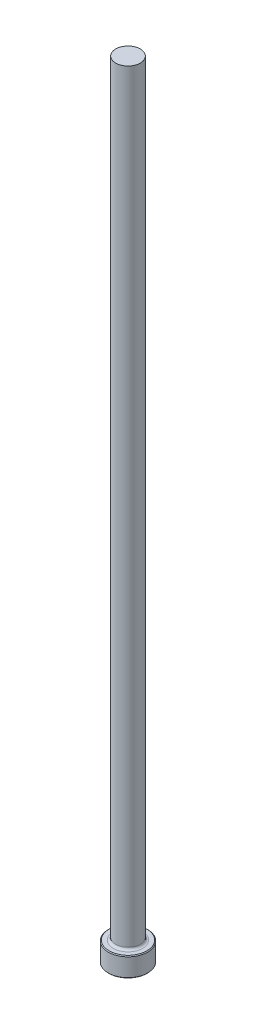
from build123d import *

# Parameters (mm, degrees)
CHAMFER1_SIZE = 0.254
FILLET1_R     = 0.762


with BuildPart() as part:
    # Sketch1 → Revolve1 (revolve)
    with BuildSketch(Plane.XY, mode=Mode.PRIVATE) as revolve1_sk:
        Polygon((0, 0), (-6.35, 0), (-6.35, 6.35), (-3.96875, 6.35), (-3.96875, 254), (0, 254), align=None)
    revolve(revolve1_sk.sketch.rotate(Axis((0, 259.958771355, 0), (0, -1, 0)), 270), axis=Axis((0, 259.958771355, 0), (0, -1, 0)))

    # Chamfer1
    chamfer1_edges = [part.edges().sort_by_distance(p)[0] for p in [
        (0, 6.35, -6.35),
        (0, 0, -6.35),
    ]]
    chamfer(chamfer1_edges, length=CHAMFER1_SIZE)

    # Fillet1
    fillet1_edges = [part.edges().sort_by_distance(p)[0] for p in [
        (0, 6.35, -3.96875),
    ]]
    fillet(fillet1_edges, radius=FILLET1_R)


solid = part.part
